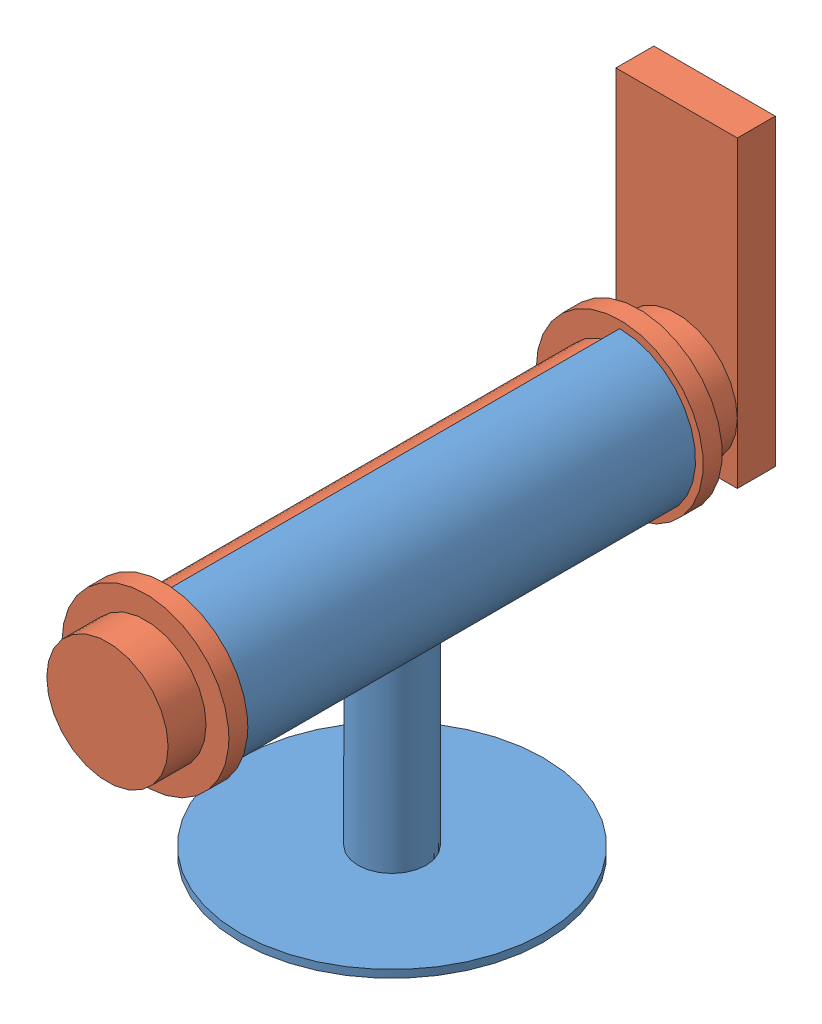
SolidWorks assembly Assemblage1.SLDASM, configuration Défaut (file format 4700). Lengths in mm.
Overall size (80 134 160).
2 component instances, 2 part files, 1 mates.
Components (placement in the parent):
- support-1: support.SLDPRT [Défaut] at (-16.0153 24.6739 -60) size (80 90 120)
- mobile-1: mobile.SLDPRT [Défaut] at (-16.0153 24.6739 -75) size (44 86 160)
Mates (geometry in assembly coordinates):
- Pivot1: hinge anti-aligned: cylinder of mobile-1 through (-16.0153 24.6739 75) axis (0 0 -1) radius 16; cylinder of support-1 through (-16.0153 24.6739 60) axis (0 0 -1) radius 16; plane of mobile-1 through (-16.0153 24.6739 -60) normal (0 0 1); plane of support-1 through (-16.0153 24.6739 -60) normal (0 0 -1)
